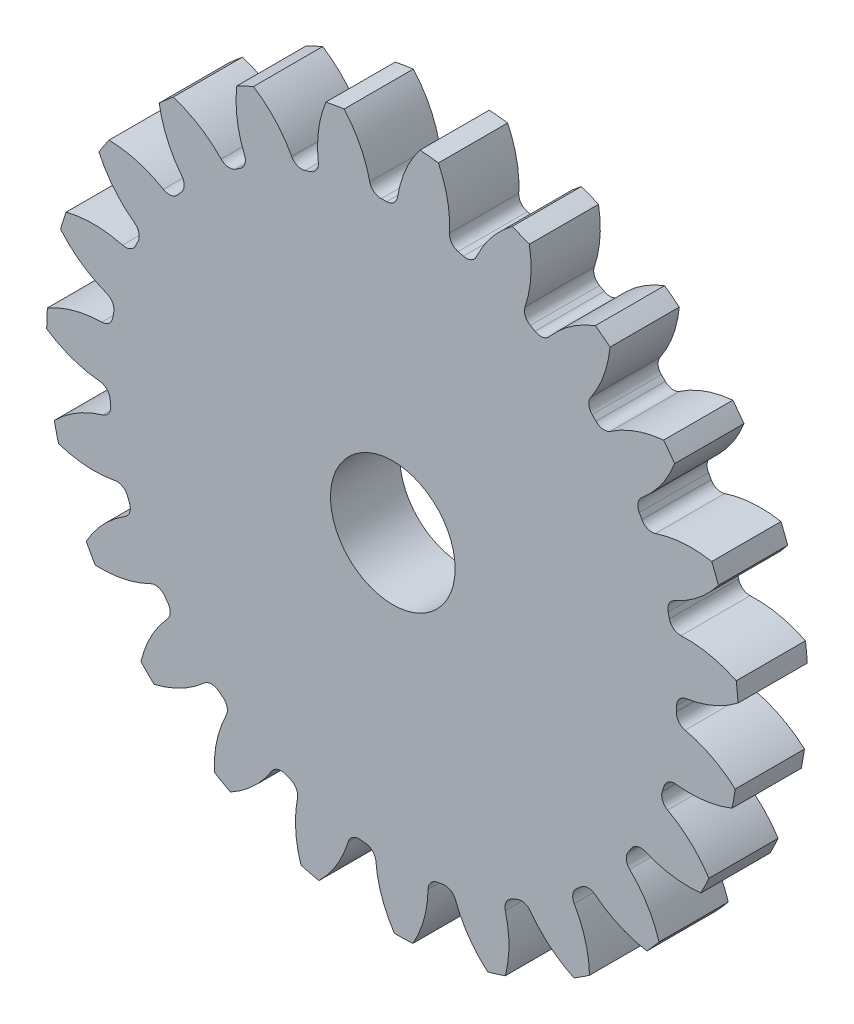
from build123d import *

# Parameters (mm, degrees)
SKETCH3_R         = 635
GEARBODY_DEPTH    = 127
TOOTHCUT_DEPTH    = 907.961410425
CIRPATTERN1_COUNT = 23
BOREDIA_R         = 114.3
BORE_DEPTH        = 12700


with BuildPart() as part:
    # Sketch3 → gearBody (new body)
    with BuildSketch(Plane.XY):
        Circle(SKETCH3_R)
    extrude(amount=GEARBODY_DEPTH)

    # Sketch2 → toothCut (cut, through all)
    with BuildSketch(Plane.XY):
        with BuildLine():
            ThreePointArc((520.132486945, -24.30403309), (520.342686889, -19.286736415), (520.504490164, -14.267645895))
            ThreePointArc((520.504490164, -14.267645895), (525.684352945, -1.137347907), (538.082692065, 5.609272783))
            ThreePointArc((538.082692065, 5.609272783), (589.261475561, 20.274862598), (635, 47.520684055))
            ThreePointArc((635, 47.520684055), (636.338673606, -23.586179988), (629.739689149, -94.398831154))
            ThreePointArc((629.739689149, -94.398831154), (586.143654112, -63.841783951), (536.190983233, -45.42771116))
            ThreePointArc((536.190983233, -45.42771116), (524.326111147, -37.781763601), (520.132486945, -24.30403309))
        make_face()
    toothcut = extrude(amount=TOOTHCUT_DEPTH, mode=Mode.SUBTRACT)

    # CirPattern1: toothCut ×23 about axis
    cirpattern1_axis = Axis((0, 0, 0), (0, 0, 1))
    for i in range(1, CIRPATTERN1_COUNT):
        add(toothcut.rotate(cirpattern1_axis, i * 360 / CIRPATTERN1_COUNT), mode=Mode.SUBTRACT)

    # boreDia → bore (cut, symmetric)
    with BuildSketch(Plane.XY):
        Circle(BOREDIA_R)
    extrude(amount=BORE_DEPTH, both=True, mode=Mode.SUBTRACT)


solid = part.part
